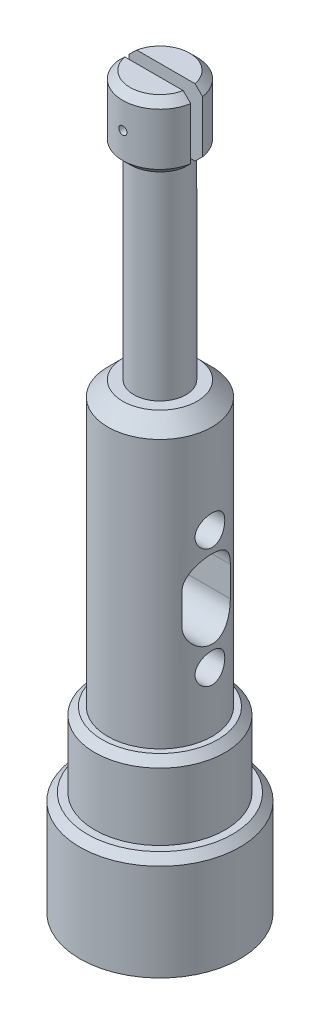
from build123d import *

# Parameters (mm, degrees)
SKETCH1_R                       = 10.75
BOSS_EXTRUDE1_DEPTH             = 14
SKETCH2_R                       = 8.75
BOSS_EXTRUDE2_DEPTH             = 10
SKETCH3_R                       = 7
BOSS_EXTRUDE3_DEPTH             = 38
SKETCH4_R                       = 3.5
BOSS_EXTRUDE4_DEPTH             = 27
SKETCH5_R                       = 5
BOSS_EXTRUDE5_DEPTH             = 9
M5X0_8_TAPPED_HOLE1_D           = 4.2
M5X0_8_TAPPED_HOLE1_DEPTH       = 17.4
M5X0_8_TAPPED_HOLE1_TIP         = 1.2618073
CUT_EXTRUDE1_DEPTH              = 100.172198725
CUT_EXTRUDE1_DEPTH_BACK         = 100.172198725
F_4_0MM_PRESS_DOWEL_HOLE1_D     = 4
F_4_0MM_PRESS_DOWEL_HOLE1_DEPTH = 10.5
F_4_0MM_PRESS_DOWEL_HOLE1_TIP   = 1.201721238
CUT_EXTRUDE2_DEPTH              = 100.172198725
CUT_EXTRUDE2_DEPTH_BACK         = 100.172198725
SKETCH16_W                      = 1.6
SKETCH16_H                      = 9
CUT_EXTRUDE3_DEPTH              = 100.172198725
CUT_EXTRUDE3_DEPTH_BACK         = 100.172198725
SKETCH17_R                      = 0.55
CHAMFER_1MM_SIZE                = 1
CHAMFER2_SIZE                   = 2


with BuildPart() as part:
    # Sketch1 → Boss-Extrude1 (new body)
    with BuildSketch(Plane(origin=(0, 0, 0), x_dir=(1, 0, 0), z_dir=(0, 1, 0))):
        with Locations(Location((0, 0, 0), (0, 0, 270))):
            Circle(SKETCH1_R)
    extrude(amount=BOSS_EXTRUDE1_DEPTH)

    # Sketch2 → Boss-Extrude2 (add)
    with BuildSketch(Plane(origin=(0, 14, 0), x_dir=(1, 0, 0), z_dir=(0, 1, 0))):
        with Locations(Location((0, 0, 0), (0, 0, 270))):
            Circle(SKETCH2_R)
    extrude(amount=BOSS_EXTRUDE2_DEPTH)

    # Sketch3 → Boss-Extrude3 (add)
    with BuildSketch(Plane(origin=(0, 24, 0), x_dir=(1, 0, 0), z_dir=(0, 1, 0))):
        with Locations(Location((0, 0, 0), (0, 0, 270))):
            Circle(SKETCH3_R)
    extrude(amount=BOSS_EXTRUDE3_DEPTH)

    # Sketch4 → Boss-Extrude4 (add)
    with BuildSketch(Plane(origin=(0, 62, 0), x_dir=(1, 0, 0), z_dir=(0, 1, 0))):
        with Locations(Location((0, 0, 0), (0, 0, 270))):
            Circle(SKETCH4_R)
    extrude(amount=BOSS_EXTRUDE4_DEPTH)

    # Sketch5 → Boss-Extrude5 (add)
    with BuildSketch(Plane(origin=(0, 89, 0), x_dir=(1, 0, 0), z_dir=(0, 1, 0))):
        with Locations(Location((0, 0, 0), (0, 0, 270))):
            Circle(SKETCH5_R)
    extrude(amount=BOSS_EXTRUDE5_DEPTH)

    # M5x0.8 Tapped Hole1
    with Locations(Plane(origin=(0, 0, 0), x_dir=(-1, 0, 0), z_dir=(0, -1, 0))):
        with Locations((0, 0)):
            Hole(M5X0_8_TAPPED_HOLE1_D / 2, depth=M5X0_8_TAPPED_HOLE1_DEPTH)
            with Locations((0, 0, -(M5X0_8_TAPPED_HOLE1_DEPTH + M5X0_8_TAPPED_HOLE1_TIP / 2))):  # 118° drill point
                Cone(0, M5X0_8_TAPPED_HOLE1_D / 2, M5X0_8_TAPPED_HOLE1_TIP, mode=Mode.SUBTRACT)

    # Sketch8 → Cut-Extrude1 (cut, two sides: drawn at the far end of the back side and taken through both)
    with BuildSketch(Plane(origin=(0, 0, 0), x_dir=(0, 0, -1), z_dir=(1, 0, 0)).offset(-CUT_EXTRUDE1_DEPTH_BACK)):
        with BuildLine():
            Line((-3.25, 38), (-3.25, 42))
            ThreePointArc((-3.25, 42), (0, 45.25), (3.25, 42))
            Line((3.25, 42), (3.25, 38))
            ThreePointArc((3.25, 38), (0, 34.75), (-3.25, 38))
        make_face()
    extrude(amount=CUT_EXTRUDE1_DEPTH + CUT_EXTRUDE1_DEPTH_BACK, mode=Mode.SUBTRACT)

    # 4.0mm Press Dowel Hole1
    with Locations(Plane(origin=(7, 40.591399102, 0), x_dir=(0, 0, -1), z_dir=(1, 0, 0))):
        with Locations((0, 7.408600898), (0, -8.591399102)):
            Hole(F_4_0MM_PRESS_DOWEL_HOLE1_D / 2, depth=F_4_0MM_PRESS_DOWEL_HOLE1_DEPTH)
            with Locations((0, 0, -(F_4_0MM_PRESS_DOWEL_HOLE1_DEPTH + F_4_0MM_PRESS_DOWEL_HOLE1_TIP / 2))):  # 118° drill point
                Cone(0, F_4_0MM_PRESS_DOWEL_HOLE1_D / 2, F_4_0MM_PRESS_DOWEL_HOLE1_TIP, mode=Mode.SUBTRACT)

    # Sketch16 → Cut-Extrude2 (cut, two sides: drawn at the far end of the back side and taken through both)
    with BuildSketch(Plane(origin=(0, 0, 0), x_dir=(0, 0, -1), z_dir=(1, 0, 0)).offset(-CUT_EXTRUDE2_DEPTH_BACK)):
        with Locations((0, 93.5)):
            Rectangle(SKETCH16_W, SKETCH16_H)
    extrude(amount=CUT_EXTRUDE2_DEPTH + CUT_EXTRUDE2_DEPTH_BACK, mode=Mode.SUBTRACT)

    # Sketch17 → Cut-Extrude3 (cut, two sides: drawn at the far end of the back side and taken through both)
    with BuildSketch(Plane.XY.offset(-CUT_EXTRUDE3_DEPTH_BACK)):
        with Locations((0, 93.5)):
            Circle(SKETCH17_R)
    extrude(amount=CUT_EXTRUDE3_DEPTH + CUT_EXTRUDE3_DEPTH_BACK, mode=Mode.SUBTRACT)

    # Chamfer 1mm
    chamfer_1mm_edges = [part.edges().sort_by_distance(p)[0] for p in [
        (0, 14, -10.75),
        (0, 24, -8.75),
        (0, 98, -5),
        (0, 98, 5),
        (0, 89, -5),
        (0, 89, 5),
    ]]
    chamfer(chamfer_1mm_edges, length=CHAMFER_1MM_SIZE)

    # Chamfer2
    chamfer2_edges = [part.edges().sort_by_distance(p)[0] for p in [
        (0, 62, -7),
    ]]
    chamfer(chamfer2_edges, length=CHAMFER2_SIZE)


solid = part.part
